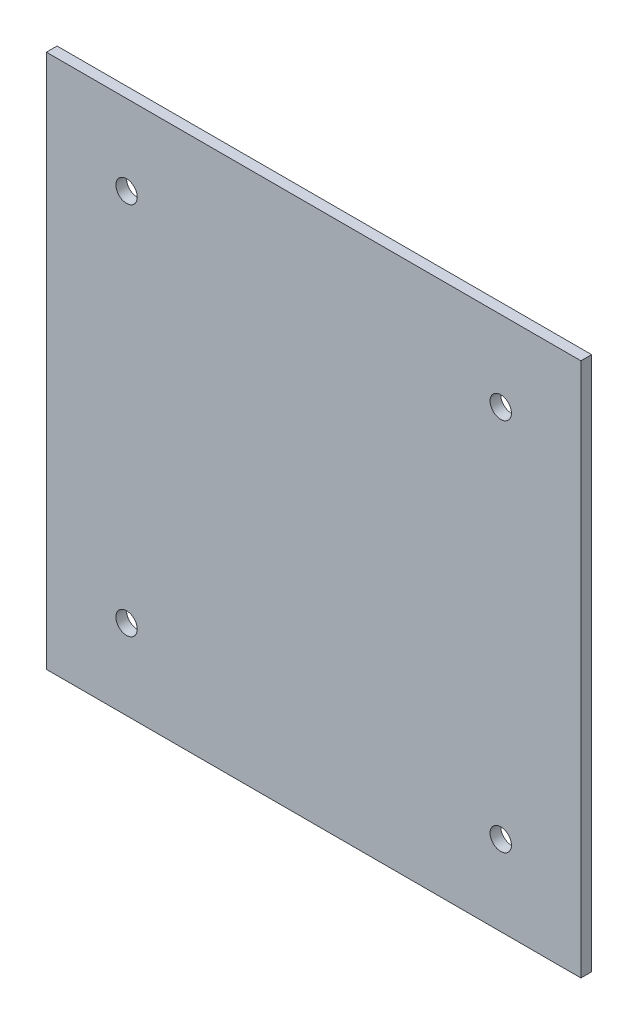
from build123d import *

# Parameters (mm, degrees)
ESQUISSE1_W                     = 200
ESQUISSE1_H                     = 200
EXTRUSION1_DEPTH                = 4
ESQUISSE2_R                     = 4
ENL_V_MAT_EXTRU_1_DEPTH         = 283.870995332
R_P_TITION_LIN_AIRE1_COUNT      = 2
R_P_TITION_LIN_AIRE1_PITCH      = 140
R_P_TITION_LIN_AIRE1_COUNT_DIR2 = 2
R_P_TITION_LIN_AIRE1_PITCH_DIR2 = 140


with BuildPart() as part:
    # Esquisse1 → Extrusion1 (new body)
    with BuildSketch(Plane.XY):
        with Locations((100, 100)):
            Rectangle(ESQUISSE1_W, ESQUISSE1_H)
    extrude(amount=EXTRUSION1_DEPTH)

    # Esquisse2 → Enl_v. mat.-Extru.1 (cut, through all)
    with BuildSketch(Plane.XY.offset(4)):
        with Locations((30, 170)):
            Circle(ESQUISSE2_R)
    enl_v_mat_extru_1 = extrude(amount=-ENL_V_MAT_EXTRU_1_DEPTH, mode=Mode.SUBTRACT)

    # R_p_tition lin_aire1: Enl_v. mat.-Extru.1 2 × 2
    with Locations(*[(i * R_P_TITION_LIN_AIRE1_PITCH, -j * R_P_TITION_LIN_AIRE1_PITCH_DIR2, 0) for i in range(R_P_TITION_LIN_AIRE1_COUNT) for j in range(R_P_TITION_LIN_AIRE1_COUNT_DIR2) if (i, j) != (0, 0)]):
        add(enl_v_mat_extru_1, mode=Mode.SUBTRACT)


solid = part.part
